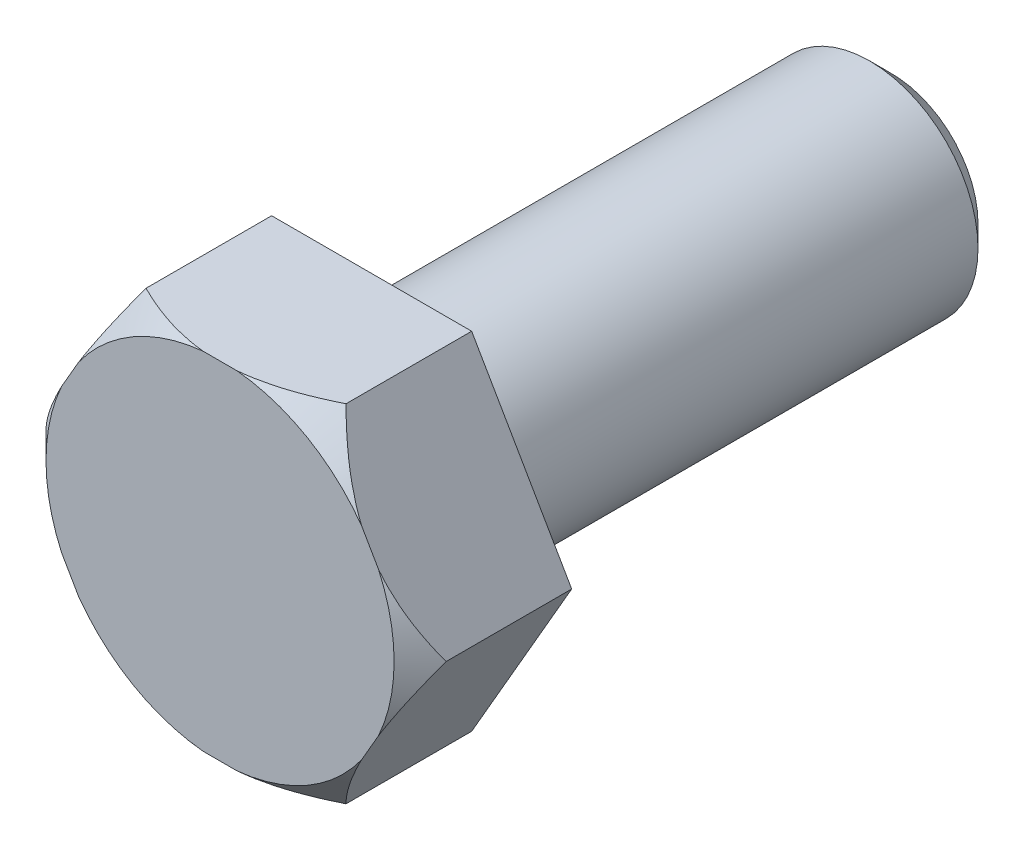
ISO-10303-21;
HEADER;
FILE_DESCRIPTION(('STEP AP214'),'2;1');
FILE_NAME('part.step','',(''),(''),'','','');
FILE_SCHEMA(('AUTOMOTIVE_DESIGN { 1 0 10303 214 1 1 1 1 }'));
ENDSEC;
DATA;
#1=APPLICATION_CONTEXT('core data for automotive mechanical design processes');
#2=APPLICATION_PROTOCOL_DEFINITION('international standard','automotive_design',2000,#1);
#3=PRODUCT_CONTEXT('',#1,'mechanical');
#4=PRODUCT('Part','Part','',(#3));
#5=PRODUCT_RELATED_PRODUCT_CATEGORY('part','',(#4));
#6=PRODUCT_DEFINITION_FORMATION('','',#4);
#7=PRODUCT_DEFINITION_CONTEXT('part definition',#1,'design');
#8=PRODUCT_DEFINITION('design','',#6,#7);
#9=PRODUCT_DEFINITION_SHAPE('','',#8);
#10=(LENGTH_UNIT() NAMED_UNIT(*) SI_UNIT(.MILLI.,.METRE.));
#11=(NAMED_UNIT(*) PLANE_ANGLE_UNIT() SI_UNIT($,.RADIAN.));
#12=(NAMED_UNIT(*) SI_UNIT($,.STERADIAN.) SOLID_ANGLE_UNIT());
#13=UNCERTAINTY_MEASURE_WITH_UNIT(LENGTH_MEASURE(1.E-05),#10,'distance_accuracy_value','');
#14=(GEOMETRIC_REPRESENTATION_CONTEXT(3) GLOBAL_UNCERTAINTY_ASSIGNED_CONTEXT((#13)) GLOBAL_UNIT_ASSIGNED_CONTEXT((#10,
#11,#12)) REPRESENTATION_CONTEXT('',''));
#15=CARTESIAN_POINT('',(0.,0.,0.));
#16=DIRECTION('',(0.,0.,1.));
#17=DIRECTION('',(1.,0.,0.));
#18=AXIS2_PLACEMENT_3D('',#15,#16,#17);
#19=CARTESIAN_POINT('',(0.,-2.5,0.));
#20=DIRECTION('',(0.,0.,1.));
#21=DIRECTION('',(1.,0.,0.));
#22=AXIS2_PLACEMENT_3D('',#19,#20,#21);
#23=PLANE('',#22);
#24=CARTESIAN_POINT('',(0.,0.,0.));
#25=DIRECTION('',(0.,0.,1.));
#26=DIRECTION('',(1.,0.,0.));
#27=AXIS2_PLACEMENT_3D('',#24,#25,#26);
#28=CIRCLE('',#27,2.5);
#29=CARTESIAN_POINT('',(2.5,0.,0.));
#30=VERTEX_POINT('',#29);
#31=EDGE_CURVE('E11',#30,#30,#28,.T.);
#32=ORIENTED_EDGE('',*,*,#31,.T.);
#33=EDGE_LOOP('',(#32));
#34=FACE_BOUND('',#33,.T.);
#35=ADVANCED_FACE('F39',(#34),#23,.T.);
#36=CARTESIAN_POINT('',(0.,0.,0.));
#37=DIRECTION('',(0.,0.,1.));
#38=DIRECTION('',(1.,0.,0.));
#39=AXIS2_PLACEMENT_3D('',#36,#37,#38);
#40=CYLINDRICAL_SURFACE('',#39,2.5);
#41=CARTESIAN_POINT('',(0.,0.,-11.5));
#42=DIRECTION('',(0.,0.,1.));
#43=DIRECTION('',(1.,0.,0.));
#44=AXIS2_PLACEMENT_3D('',#41,#42,#43);
#45=CIRCLE('',#44,2.5);
#46=CARTESIAN_POINT('',(2.5,0.,-11.5));
#47=VERTEX_POINT('',#46);
#48=EDGE_CURVE('E45',#47,#47,#45,.T.);
#49=ORIENTED_EDGE('',*,*,#48,.T.);
#50=EDGE_LOOP('',(#49));
#51=FACE_BOUND('',#50,.T.);
#52=ORIENTED_EDGE('',*,*,#31,.F.);
#53=EDGE_LOOP('',(#52));
#54=FACE_BOUND('',#53,.T.);
#55=ADVANCED_FACE('F65',(#51,#54),#40,.T.);
#56=CARTESIAN_POINT('',(0.,0.,-11.5));
#57=DIRECTION('',(0.,0.,1.));
#58=DIRECTION('',(1.,0.,0.));
#59=AXIS2_PLACEMENT_3D('',#56,#57,#58);
#60=CONICAL_SURFACE('',#59,2.5,0.785398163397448);
#61=CARTESIAN_POINT('',(0.,0.,-12.));
#62=DIRECTION('',(0.,0.,1.));
#63=DIRECTION('',(1.,0.,0.));
#64=AXIS2_PLACEMENT_3D('',#61,#62,#63);
#65=CIRCLE('',#64,2.);
#66=CARTESIAN_POINT('',(2.,0.,-12.));
#67=VERTEX_POINT('',#66);
#68=EDGE_CURVE('E49',#67,#67,#65,.T.);
#69=ORIENTED_EDGE('',*,*,#68,.T.);
#70=EDGE_LOOP('',(#69));
#71=FACE_BOUND('',#70,.T.);
#72=ORIENTED_EDGE('',*,*,#48,.F.);
#73=EDGE_LOOP('',(#72));
#74=FACE_BOUND('',#73,.T.);
#75=ADVANCED_FACE('F56',(#71,#74),#60,.T.);
#76=CARTESIAN_POINT('',(0.,-2.,-12.));
#77=DIRECTION('',(0.,0.,-1.));
#78=DIRECTION('',(-1.,0.,0.));
#79=AXIS2_PLACEMENT_3D('',#76,#77,#78);
#80=PLANE('',#79);
#81=ORIENTED_EDGE('',*,*,#68,.F.);
#82=EDGE_LOOP('',(#81));
#83=FACE_BOUND('',#82,.T.);
#84=ADVANCED_FACE('F59',(#83),#80,.T.);
#85=CLOSED_SHELL('',(#35,#55,#75,#84));
#86=MANIFOLD_SOLID_BREP('B2',#85);
#87=CARTESIAN_POINT('',(2.3094010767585,-4.,3.5));
#88=DIRECTION('',(-0.866025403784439,0.5,0.));
#89=DIRECTION('',(-0.5,-0.866025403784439,0.));
#90=AXIS2_PLACEMENT_3D('',#87,#88,#89);
#91=PLANE('',#90);
#92=DIRECTION('',(0.,0.,-1.));
#93=VECTOR('',#92,1.);
#94=CARTESIAN_POINT('',(4.61880215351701,0.,3.5));
#95=LINE('',#94,#93);
#96=CARTESIAN_POINT('',(4.61880215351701,0.,2.9));
#97=VERTEX_POINT('',#96);
#98=CARTESIAN_POINT('',(4.61880215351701,0.,0.));
#99=VERTEX_POINT('',#98);
#100=EDGE_CURVE('E242',#97,#99,#95,.T.);
#101=ORIENTED_EDGE('',*,*,#100,.F.);
#102=CARTESIAN_POINT('',(6.23236114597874,2.79476615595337,0.688498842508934));
#103=CARTESIAN_POINT('',(6.17765325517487,2.70000930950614,0.777178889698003));
#104=CARTESIAN_POINT('',(6.12272857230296,2.60487696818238,0.865328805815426));
#105=CARTESIAN_POINT('',(6.01237057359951,2.41373130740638,1.04036549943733));
#106=CARTESIAN_POINT('',(5.95693721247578,2.31771790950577,1.12725216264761));
#107=CARTESIAN_POINT('',(5.84536515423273,2.12446943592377,1.29974670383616));
#108=CARTESIAN_POINT('',(5.78922510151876,2.02723201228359,1.3853510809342));
#109=CARTESIAN_POINT('',(5.67628342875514,1.83161129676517,1.55479243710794));
#110=CARTESIAN_POINT('',(5.61948182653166,1.73322803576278,1.63862946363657));
#111=CARTESIAN_POINT('',(5.50353794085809,1.53240733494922,1.80647993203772));
#112=CARTESIAN_POINT('',(5.44437430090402,1.42993290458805,1.89043450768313));
#113=CARTESIAN_POINT('',(5.32511378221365,1.22336762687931,2.05564703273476));
#114=CARTESIAN_POINT('',(5.26501693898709,1.11927684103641,2.13690508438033));
#115=CARTESIAN_POINT('',(5.14378925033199,0.909304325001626,2.296059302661));
#116=CARTESIAN_POINT('',(5.08265932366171,0.803424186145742,2.37395825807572));
#117=CARTESIAN_POINT('',(4.95915384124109,0.589506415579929,2.52568435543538));
#118=CARTESIAN_POINT('',(4.89677844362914,0.481469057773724,2.59951200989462));
#119=CARTESIAN_POINT('',(4.76893339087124,0.260034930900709,2.74398038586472));
#120=CARTESIAN_POINT('',(4.7034254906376,0.146571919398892,2.81448663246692));
#121=CARTESIAN_POINT('',(4.570685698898,-0.0833401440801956,2.94879092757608));
#122=CARTESIAN_POINT('',(4.50345356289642,-0.199789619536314,3.01258801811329));
#123=CARTESIAN_POINT('',(4.3674844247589,-0.43529507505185,3.13137401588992));
#124=CARTESIAN_POINT('',(4.29875750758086,-0.554333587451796,3.1864086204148));
#125=CARTESIAN_POINT('',(4.15941510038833,-0.795681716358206,3.28596217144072));
#126=CARTESIAN_POINT('',(4.0888001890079,-0.91799033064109,3.3304842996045));
#127=CARTESIAN_POINT('',(3.95986044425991,-1.14132051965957,3.39923411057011));
#128=CARTESIAN_POINT('',(3.90183954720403,-1.24181566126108,3.42572915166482));
#129=CARTESIAN_POINT('',(3.78491444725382,-1.44433587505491,3.46929589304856));
#130=CARTESIAN_POINT('',(3.72601037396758,-1.54636072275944,3.48636896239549));
#131=CARTESIAN_POINT('',(3.60778145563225,-1.75113921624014,3.5102149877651));
#132=CARTESIAN_POINT('',(3.54845754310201,-1.85389124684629,3.51700617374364));
#133=CARTESIAN_POINT('',(3.42974154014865,-2.059513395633,3.51997326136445));
#134=CARTESIAN_POINT('',(3.3703494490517,-2.16238351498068,3.51614905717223));
#135=CARTESIAN_POINT('',(3.2521230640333,-2.36715762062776,3.49812146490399));
#136=CARTESIAN_POINT('',(3.19328771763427,-2.46906342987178,3.48394524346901));
#137=CARTESIAN_POINT('',(3.07639557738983,-2.67152655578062,3.44597172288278));
#138=CARTESIAN_POINT('',(3.01833897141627,-2.77208354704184,3.42217214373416));
#139=CARTESIAN_POINT('',(2.90311219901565,-2.97166217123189,3.36593528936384));
#140=CARTESIAN_POINT('',(2.84594516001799,-3.0706783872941,3.33347269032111));
#141=CARTESIAN_POINT('',(2.73281133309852,-3.26663192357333,3.26114482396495));
#142=CARTESIAN_POINT('',(2.67684448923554,-3.36356934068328,3.22127990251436));
#143=CARTESIAN_POINT('',(2.54652000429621,-3.58929797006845,3.12008468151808));
#144=CARTESIAN_POINT('',(2.47266940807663,-3.71721095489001,3.05615257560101));
#145=CARTESIAN_POINT('',(2.32705313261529,-3.969425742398,2.91934821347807));
#146=CARTESIAN_POINT('',(2.25528857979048,-4.09372559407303,2.84647123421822));
#147=CARTESIAN_POINT('',(2.11349363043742,-4.33932165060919,2.69363109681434));
#148=CARTESIAN_POINT('',(2.04346714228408,-4.46061108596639,2.61365354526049));
#149=CARTESIAN_POINT('',(1.90505877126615,-4.7003414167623,2.4482849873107));
#150=CARTESIAN_POINT('',(1.83667660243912,-4.81878280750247,2.36289493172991));
#151=CARTESIAN_POINT('',(1.70098891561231,-5.05380077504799,2.18743214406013));
#152=CARTESIAN_POINT('',(1.63368983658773,-5.17036619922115,2.09733958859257));
#153=CARTESIAN_POINT('',(1.50027452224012,-5.401448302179,1.91370612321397));
#154=CARTESIAN_POINT('',(1.43415838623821,-5.51596480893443,1.82016492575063));
#155=CARTESIAN_POINT('',(1.30300471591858,-5.74312962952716,1.63040915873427));
#156=CARTESIAN_POINT('',(1.23796608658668,-5.85577983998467,1.53419760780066));
#157=CARTESIAN_POINT('',(1.10874167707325,-6.07960308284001,1.33950918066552));
#158=CARTESIAN_POINT('',(1.0445559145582,-6.19077608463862,1.24103225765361));
#159=CARTESIAN_POINT('',(0.932766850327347,-6.38440042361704,1.06690301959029));
#160=CARTESIAN_POINT('',(0.885004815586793,-6.46712669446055,0.991657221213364));
#161=CARTESIAN_POINT('',(0.790056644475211,-6.63158175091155,0.840569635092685));
#162=CARTESIAN_POINT('',(0.742868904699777,-6.71331331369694,0.764731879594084));
#163=CARTESIAN_POINT('',(0.695842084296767,-6.79476615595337,0.688498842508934));
#164=B_SPLINE_CURVE_WITH_KNOTS('',3,(#102,#103,#104,#105,#106,#107,#108,#109,#110,#111,#112,
#113,#114,#115,#116,#117,#118,#119,#120,#121,#122,#123,#124,#125,#126,#127,#128,#129,#130,#131,
#132,#133,#134,#135,#136,#137,#138,#139,#140,#141,#142,#143,#144,#145,#146,#147,#148,#149,#150,
#151,#152,#153,#154,#155,#156,#157,#158,#159,#160,#161,#162,#163),.UNSPECIFIED.,.F.,.F.,(4,2,2,
2,2,2,2,2,2,2,2,2,2,2,2,2,2,2,2,2,2,2,2,2,2,2,2,2,2,2,4),(0.,0.422523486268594,
0.845084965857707,1.26864344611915,1.69219053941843,2.12741530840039,2.56262355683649,
2.99746324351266,3.43224806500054,3.87844266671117,4.32470089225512,4.76854968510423,
5.21226397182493,5.56900884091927,5.92570185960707,6.28176171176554,6.63782511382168,
6.99295744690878,7.34817396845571,7.70444045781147,8.06069030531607,8.54311709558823,
9.02579972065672,9.50948415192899,9.99308384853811,10.4789192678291,10.964795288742,
11.450142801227,11.9355003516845,12.3002974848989,12.6635031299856),.UNSPECIFIED.);
#165=CARTESIAN_POINT('',(3.65824766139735,-1.66372918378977,3.5));
#166=VERTEX_POINT('',#165);
#167=EDGE_CURVE('E220',#97,#166,#164,.T.);
#168=ORIENTED_EDGE('',*,*,#167,.T.);
#169=DIRECTION('',(0.5,0.866025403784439,0.));
#170=VECTOR('',#169,1.);
#171=CARTESIAN_POINT('',(2.3094010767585,-4.,3.5));
#172=LINE('',#171,#170);
#173=CARTESIAN_POINT('',(3.26995556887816,-2.33627081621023,3.5));
#174=VERTEX_POINT('',#173);
#175=EDGE_CURVE('E234',#174,#166,#172,.T.);
#176=ORIENTED_EDGE('',*,*,#175,.F.);
#177=CARTESIAN_POINT('',(2.3094010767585,-4.,2.9));
#178=VERTEX_POINT('',#177);
#179=EDGE_CURVE('E307',#174,#178,#164,.T.);
#180=ORIENTED_EDGE('',*,*,#179,.T.);
#181=DIRECTION('',(0.,0.,-1.));
#182=VECTOR('',#181,1.);
#183=CARTESIAN_POINT('',(2.3094010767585,-4.,3.5));
#184=LINE('',#183,#182);
#185=CARTESIAN_POINT('',(2.3094010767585,-4.,0.));
#186=VERTEX_POINT('',#185);
#187=EDGE_CURVE('E215',#178,#186,#184,.T.);
#188=ORIENTED_EDGE('',*,*,#187,.T.);
#189=DIRECTION('',(0.5,0.866025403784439,0.));
#190=VECTOR('',#189,1.);
#191=CARTESIAN_POINT('',(2.3094010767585,-4.,0.));
#192=LINE('',#191,#190);
#193=EDGE_CURVE('E216',#186,#99,#192,.T.);
#194=ORIENTED_EDGE('',*,*,#193,.T.);
#195=EDGE_LOOP('',(#101,#168,#176,#180,#188,#194));
#196=FACE_BOUND('',#195,.T.);
#197=ADVANCED_FACE('F95',(#196),#91,.F.);
#198=CARTESIAN_POINT('',(4.61880215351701,0.,3.5));
#199=DIRECTION('',(-0.866025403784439,-0.5,0.));
#200=DIRECTION('',(0.5,-0.866025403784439,0.));
#201=AXIS2_PLACEMENT_3D('',#198,#199,#200);
#202=PLANE('',#201);
#203=DIRECTION('',(0.,0.,-1.));
#204=VECTOR('',#203,1.);
#205=CARTESIAN_POINT('',(2.3094010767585,4.,3.5));
#206=LINE('',#205,#204);
#207=CARTESIAN_POINT('',(2.3094010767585,4.,2.9));
#208=VERTEX_POINT('',#207);
#209=CARTESIAN_POINT('',(2.3094010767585,4.,0.));
#210=VERTEX_POINT('',#209);
#211=EDGE_CURVE('E241',#208,#210,#206,.T.);
#212=ORIENTED_EDGE('',*,*,#211,.F.);
#213=CARTESIAN_POINT('',(0.695842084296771,6.79476615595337,0.688498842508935));
#214=CARTESIAN_POINT('',(0.75054997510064,6.70000930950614,0.777178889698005));
#215=CARTESIAN_POINT('',(0.805474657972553,6.60487696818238,0.865328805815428));
#216=CARTESIAN_POINT('',(0.915832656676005,6.41373130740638,1.04036549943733));
#217=CARTESIAN_POINT('',(0.971266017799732,6.31771790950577,1.12725216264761));
#218=CARTESIAN_POINT('',(1.08283807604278,6.12446943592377,1.29974670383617));
#219=CARTESIAN_POINT('',(1.13897812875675,6.02723201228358,1.3853510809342));
#220=CARTESIAN_POINT('',(1.25191980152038,5.83161129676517,1.55479243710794));
#221=CARTESIAN_POINT('',(1.30872140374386,5.73322803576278,1.63862946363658));
#222=CARTESIAN_POINT('',(1.42466528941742,5.53240733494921,1.80647993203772));
#223=CARTESIAN_POINT('',(1.48382892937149,5.42993290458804,1.89043450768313));
#224=CARTESIAN_POINT('',(1.60308944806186,5.22336762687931,2.05564703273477));
#225=CARTESIAN_POINT('',(1.66318629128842,5.11927684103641,2.13690508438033));
#226=CARTESIAN_POINT('',(1.78441397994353,4.90930432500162,2.296059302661));
#227=CARTESIAN_POINT('',(1.84554390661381,4.80342418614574,2.37395825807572));
#228=CARTESIAN_POINT('',(1.96904938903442,4.58950641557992,2.52568435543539));
#229=CARTESIAN_POINT('',(2.03142478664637,4.48146905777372,2.59951200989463));
#230=CARTESIAN_POINT('',(2.15926983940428,4.2600349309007,2.74398038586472));
#231=CARTESIAN_POINT('',(2.22477773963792,4.14657191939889,2.81448663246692));
#232=CARTESIAN_POINT('',(2.35751753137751,3.9166598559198,2.94879092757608));
#233=CARTESIAN_POINT('',(2.42474966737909,3.80021038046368,3.01258801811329));
#234=CARTESIAN_POINT('',(2.56071880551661,3.56470492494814,3.13137401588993));
#235=CARTESIAN_POINT('',(2.62944572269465,3.4456664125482,3.1864086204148));
#236=CARTESIAN_POINT('',(2.76878812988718,3.20431828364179,3.28596217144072));
#237=CARTESIAN_POINT('',(2.83940304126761,3.0820096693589,3.3304842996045));
#238=CARTESIAN_POINT('',(2.9683427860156,2.85867948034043,3.39923411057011));
#239=CARTESIAN_POINT('',(3.02636368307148,2.75818433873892,3.42572915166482));
#240=CARTESIAN_POINT('',(3.14328878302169,2.55566412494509,3.46929589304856));
#241=CARTESIAN_POINT('',(3.20219285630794,2.45363927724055,3.48636896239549));
#242=CARTESIAN_POINT('',(3.32042177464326,2.24886078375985,3.5102149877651));
#243=CARTESIAN_POINT('',(3.3797456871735,2.1461087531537,3.51700617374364));
#244=CARTESIAN_POINT('',(3.49846169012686,1.94048660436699,3.51997326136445));
#245=CARTESIAN_POINT('',(3.55785378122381,1.83761648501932,3.51614905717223));
#246=CARTESIAN_POINT('',(3.67608016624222,1.63284237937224,3.49812146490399));
#247=CARTESIAN_POINT('',(3.73491551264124,1.53093657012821,3.48394524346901));
#248=CARTESIAN_POINT('',(3.85180765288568,1.32847344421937,3.44597172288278));
#249=CARTESIAN_POINT('',(3.90986425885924,1.22791645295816,3.42217214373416));
#250=CARTESIAN_POINT('',(4.02509103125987,1.02833782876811,3.36593528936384));
#251=CARTESIAN_POINT('',(4.08225807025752,0.929321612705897,3.33347269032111));
#252=CARTESIAN_POINT('',(4.19539189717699,0.733368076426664,3.26114482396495));
#253=CARTESIAN_POINT('',(4.25135874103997,0.636430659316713,3.22127990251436));
#254=CARTESIAN_POINT('',(4.3816832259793,0.410702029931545,3.12008468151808));
#255=CARTESIAN_POINT('',(4.45553382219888,0.282789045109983,3.05615257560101));
#256=CARTESIAN_POINT('',(4.60115009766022,0.0305742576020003,2.91934821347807));
#257=CARTESIAN_POINT('',(4.67291465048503,-0.0937255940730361,2.84647123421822));
#258=CARTESIAN_POINT('',(4.81470959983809,-0.33932165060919,2.69363109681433));
#259=CARTESIAN_POINT('',(4.88473608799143,-0.460611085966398,2.61365354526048));
#260=CARTESIAN_POINT('',(5.02314445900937,-0.700341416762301,2.4482849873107));
#261=CARTESIAN_POINT('',(5.0915266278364,-0.818782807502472,2.36289493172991));
#262=CARTESIAN_POINT('',(5.2272143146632,-1.05380077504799,2.18743214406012));
#263=CARTESIAN_POINT('',(5.29451339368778,-1.17036619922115,2.09733958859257));
#264=CARTESIAN_POINT('',(5.4279287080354,-1.401448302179,1.91370612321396));
#265=CARTESIAN_POINT('',(5.4940448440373,-1.51596480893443,1.82016492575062));
#266=CARTESIAN_POINT('',(5.62519851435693,-1.74312962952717,1.63040915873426));
#267=CARTESIAN_POINT('',(5.69023714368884,-1.85577983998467,1.53419760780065));
#268=CARTESIAN_POINT('',(5.81946155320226,-2.07960308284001,1.33950918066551));
#269=CARTESIAN_POINT('',(5.88364731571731,-2.19077608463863,1.24103225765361));
#270=CARTESIAN_POINT('',(5.99543637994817,-2.38440042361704,1.06690301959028));
#271=CARTESIAN_POINT('',(6.04319841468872,-2.46712669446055,0.991657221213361));
#272=CARTESIAN_POINT('',(6.1381465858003,-2.63158175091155,0.840569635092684));
#273=CARTESIAN_POINT('',(6.18533432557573,-2.71331331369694,0.764731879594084));
#274=CARTESIAN_POINT('',(6.23236114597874,-2.79476615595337,0.688498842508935));
#275=B_SPLINE_CURVE_WITH_KNOTS('',3,(#213,#214,#215,#216,#217,#218,#219,#220,#221,#222,#223,
#224,#225,#226,#227,#228,#229,#230,#231,#232,#233,#234,#235,#236,#237,#238,#239,#240,#241,#242,
#243,#244,#245,#246,#247,#248,#249,#250,#251,#252,#253,#254,#255,#256,#257,#258,#259,#260,#261,
#262,#263,#264,#265,#266,#267,#268,#269,#270,#271,#272,#273,#274),.UNSPECIFIED.,.F.,.F.,(4,2,2,
2,2,2,2,2,2,2,2,2,2,2,2,2,2,2,2,2,2,2,2,2,2,2,2,2,2,2,4),(0.,0.422523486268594,
0.845084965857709,1.26864344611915,1.69219053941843,2.12741530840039,2.5626235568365,
2.99746324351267,3.43224806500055,3.87844266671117,4.32470089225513,4.76854968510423,
5.21226397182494,5.56900884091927,5.92570185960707,6.28176171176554,6.63782511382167,
6.99295744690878,7.34817396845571,7.70444045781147,8.06069030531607,8.54311709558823,
9.02579972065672,9.50948415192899,9.99308384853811,10.4789192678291,10.9647952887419,
11.450142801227,11.9355003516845,12.3002974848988,12.6635031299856),.UNSPECIFIED.);
#276=CARTESIAN_POINT('',(3.26995556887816,2.33627081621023,3.5));
#277=VERTEX_POINT('',#276);
#278=EDGE_CURVE('E270',#208,#277,#275,.T.);
#279=ORIENTED_EDGE('',*,*,#278,.T.);
#280=DIRECTION('',(-0.5,0.866025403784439,0.));
#281=VECTOR('',#280,1.);
#282=CARTESIAN_POINT('',(4.61880215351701,0.,3.5));
#283=LINE('',#282,#281);
#284=CARTESIAN_POINT('',(3.65824766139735,1.66372918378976,3.5));
#285=VERTEX_POINT('',#284);
#286=EDGE_CURVE('E209',#285,#277,#283,.T.);
#287=ORIENTED_EDGE('',*,*,#286,.F.);
#288=EDGE_CURVE('E275',#285,#97,#275,.T.);
#289=ORIENTED_EDGE('',*,*,#288,.T.);
#290=ORIENTED_EDGE('',*,*,#100,.T.);
#291=DIRECTION('',(-0.5,0.866025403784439,0.));
#292=VECTOR('',#291,1.);
#293=CARTESIAN_POINT('',(4.61880215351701,0.,0.));
#294=LINE('',#293,#292);
#295=EDGE_CURVE('E219',#99,#210,#294,.T.);
#296=ORIENTED_EDGE('',*,*,#295,.T.);
#297=EDGE_LOOP('',(#212,#279,#287,#289,#290,#296));
#298=FACE_BOUND('',#297,.T.);
#299=ADVANCED_FACE('F280',(#298),#202,.F.);
#300=CARTESIAN_POINT('',(2.3094010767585,4.,3.5));
#301=DIRECTION('',(0.,-1.,0.));
#302=DIRECTION('',(1.,0.,0.));
#303=AXIS2_PLACEMENT_3D('',#300,#301,#302);
#304=PLANE('',#303);
#305=DIRECTION('',(0.,0.,-1.));
#306=VECTOR('',#305,1.);
#307=CARTESIAN_POINT('',(-2.3094010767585,4.,3.5));
#308=LINE('',#307,#306);
#309=CARTESIAN_POINT('',(-2.3094010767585,4.,2.9));
#310=VERTEX_POINT('',#309);
#311=CARTESIAN_POINT('',(-2.3094010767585,4.,0.));
#312=VERTEX_POINT('',#311);
#313=EDGE_CURVE('E239',#310,#312,#308,.T.);
#314=ORIENTED_EDGE('',*,*,#313,.F.);
#315=CARTESIAN_POINT('',(-5.10416723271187,4.,1.03401047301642));
#316=CARTESIAN_POINT('',(-4.98985882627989,4.,1.12396648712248));
#317=CARTESIAN_POINT('',(-4.87500222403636,4.,1.21323480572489));
#318=CARTESIAN_POINT('',(-4.64398100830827,4.,1.39010065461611));
#319=CARTESIAN_POINT('',(-4.52781618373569,4.,1.47769790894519));
#320=CARTESIAN_POINT('',(-4.29341594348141,4.,1.6513323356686));
#321=CARTESIAN_POINT('',(-4.17517305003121,4.,1.7373594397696));
#322=CARTESIAN_POINT('',(-3.93695487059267,4.,1.90697407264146));
#323=CARTESIAN_POINT('',(-3.81697966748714,4.,1.99056171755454));
#324=CARTESIAN_POINT('',(-3.56903053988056,4.,2.15883212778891));
#325=CARTESIAN_POINT('',(-3.44095437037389,4.,2.24336480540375));
#326=CARTESIAN_POINT('',(-3.18221357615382,4.,2.40836670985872));
#327=CARTESIAN_POINT('',(-3.05154916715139,4.,2.48883627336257));
#328=CARTESIAN_POINT('',(-2.78744760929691,4.,2.6445324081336));
#329=CARTESIAN_POINT('',(-2.65401614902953,4.,2.71976857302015));
#330=CARTESIAN_POINT('',(-2.38373289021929,4.,2.86379345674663));
#331=CARTESIAN_POINT('',(-2.24688202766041,4.,2.93258391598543));
#332=CARTESIAN_POINT('',(-1.98367043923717,4.,3.05530153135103));
#333=CARTESIAN_POINT('',(-1.85768607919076,4.,3.11002999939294));
#334=CARTESIAN_POINT('',(-1.60243753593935,4.,3.21135635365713));
#335=CARTESIAN_POINT('',(-1.47317303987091,4.,3.25795346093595));
#336=CARTESIAN_POINT('',(-1.21292441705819,4.,3.34074586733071));
#337=CARTESIAN_POINT('',(-1.08197637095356,4.,3.37705304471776));
#338=CARTESIAN_POINT('',(-0.817433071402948,4.,3.43815768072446));
#339=CARTESIAN_POINT('',(-0.683838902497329,4.,3.46295975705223));
#340=CARTESIAN_POINT('',(-0.412316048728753,4.,3.49989685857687));
#341=CARTESIAN_POINT('',(-0.274353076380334,4.,3.51178529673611));
#342=CARTESIAN_POINT('',(0.00205892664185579,4.,3.52118634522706));
#343=CARTESIAN_POINT('',(0.1405079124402,4.,3.51870024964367));
#344=CARTESIAN_POINT('',(0.41681462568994,4.,3.49951454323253));
#345=CARTESIAN_POINT('',(0.554669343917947,4.,3.48277242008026));
#346=CARTESIAN_POINT('',(0.828137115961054,4.,3.43620184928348));
#347=CARTESIAN_POINT('',(0.963749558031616,4.,3.40636988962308));
#348=CARTESIAN_POINT('',(1.27307598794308,4.,3.32450160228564));
#349=CARTESIAN_POINT('',(1.44572159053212,4.,3.26846152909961));
#350=CARTESIAN_POINT('',(1.78533180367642,4.,3.14129797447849));
#351=CARTESIAN_POINT('',(1.95229295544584,4.,3.07016549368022));
#352=CARTESIAN_POINT('',(2.28202183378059,4.,2.91595160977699));
#353=CARTESIAN_POINT('',(2.44474983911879,4.,2.83278642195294));
#354=CARTESIAN_POINT('',(2.76538092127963,4.,2.65780460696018));
#355=CARTESIAN_POINT('',(2.92328510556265,4.,2.56598998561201));
#356=CARTESIAN_POINT('',(3.25793446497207,4.,2.36185945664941));
#357=CARTESIAN_POINT('',(3.43404610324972,4.,2.24851177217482));
#358=CARTESIAN_POINT('',(3.78201930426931,4.,2.01543949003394));
#359=CARTESIAN_POINT('',(3.95387990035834,4.,1.89571346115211));
#360=CARTESIAN_POINT('',(4.29033684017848,4.,1.65419733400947));
#361=CARTESIAN_POINT('',(4.45500968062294,4.,1.53251336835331));
#362=CARTESIAN_POINT('',(4.69993893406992,4.,1.34736923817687));
#363=CARTESIAN_POINT('',(4.78120758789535,4.,1.28524011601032));
#364=CARTESIAN_POINT('',(4.94313113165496,4.,1.16019346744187));
#365=CARTESIAN_POINT('',(5.02378604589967,4.,1.09727597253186));
#366=CARTESIAN_POINT('',(5.10416723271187,4.,1.03401047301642));
#367=B_SPLINE_CURVE_WITH_KNOTS('',3,(#315,#316,#317,#318,#319,#320,#321,#322,#323,#324,#325,
#326,#327,#328,#329,#330,#331,#332,#333,#334,#335,#336,#337,#338,#339,#340,#341,#342,#343,#344,
#345,#346,#347,#348,#349,#350,#351,#352,#353,#354,#355,#356,#357,#358,#359,#360,#361,#362,#363,
#364,#365,#366),.UNSPECIFIED.,.F.,.F.,(4,2,2,2,2,2,2,2,2,2,2,2,2,2,2,2,2,2,2,2,2,2,2,2,2,4),(0.,
0.436384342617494,0.872840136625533,1.31149215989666,1.75012326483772,2.2104351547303,
2.67070884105,3.13011523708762,3.58939722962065,4.00124375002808,4.4131297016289,
4.82034865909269,5.22740403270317,5.64210248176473,6.05676359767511,6.47266560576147,
6.88867926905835,7.43226364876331,7.97617307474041,8.52407040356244,9.07184098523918,
9.6999549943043,10.3282105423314,10.9424080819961,11.2492945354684,11.5561687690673),.UNSPECIFIED.);
#368=CARTESIAN_POINT('',(-0.388292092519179,4.,3.5));
#369=VERTEX_POINT('',#368);
#370=EDGE_CURVE('E257',#310,#369,#367,.T.);
#371=ORIENTED_EDGE('',*,*,#370,.T.);
#372=DIRECTION('',(-1.,0.,0.));
#373=VECTOR('',#372,1.);
#374=CARTESIAN_POINT('',(2.3094010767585,4.,3.5));
#375=LINE('',#374,#373);
#376=CARTESIAN_POINT('',(0.38829209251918,4.,3.5));
#377=VERTEX_POINT('',#376);
#378=EDGE_CURVE('E205',#377,#369,#375,.T.);
#379=ORIENTED_EDGE('',*,*,#378,.F.);
#380=EDGE_CURVE('E263',#377,#208,#367,.T.);
#381=ORIENTED_EDGE('',*,*,#380,.T.);
#382=ORIENTED_EDGE('',*,*,#211,.T.);
#383=DIRECTION('',(-1.,0.,0.));
#384=VECTOR('',#383,1.);
#385=CARTESIAN_POINT('',(2.3094010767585,4.,0.));
#386=LINE('',#385,#384);
#387=EDGE_CURVE('E223',#210,#312,#386,.T.);
#388=ORIENTED_EDGE('',*,*,#387,.T.);
#389=EDGE_LOOP('',(#314,#371,#379,#381,#382,#388));
#390=FACE_BOUND('',#389,.T.);
#391=ADVANCED_FACE('F261',(#390),#304,.F.);
#392=CARTESIAN_POINT('',(-2.3094010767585,4.,3.5));
#393=DIRECTION('',(0.866025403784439,-0.5,0.));
#394=DIRECTION('',(0.5,0.866025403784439,0.));
#395=AXIS2_PLACEMENT_3D('',#392,#393,#394);
#396=PLANE('',#395);
#397=DIRECTION('',(0.,0.,-1.));
#398=VECTOR('',#397,1.);
#399=CARTESIAN_POINT('',(-4.61880215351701,0.,3.5));
#400=LINE('',#399,#398);
#401=CARTESIAN_POINT('',(-4.61880215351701,0.,2.9));
#402=VERTEX_POINT('',#401);
#403=CARTESIAN_POINT('',(-4.61880215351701,0.,0.));
#404=VERTEX_POINT('',#403);
#405=EDGE_CURVE('E197',#402,#404,#400,.T.);
#406=ORIENTED_EDGE('',*,*,#405,.F.);
#407=CARTESIAN_POINT('',(-6.23236114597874,-2.79476615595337,0.688498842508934));
#408=CARTESIAN_POINT('',(-6.17765325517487,-2.70000930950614,0.777178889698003));
#409=CARTESIAN_POINT('',(-6.12272857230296,-2.60487696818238,0.865328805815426));
#410=CARTESIAN_POINT('',(-6.01237057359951,-2.41373130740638,1.04036549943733));
#411=CARTESIAN_POINT('',(-5.95693721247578,-2.31771790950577,1.12725216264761));
#412=CARTESIAN_POINT('',(-5.84536515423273,-2.12446943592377,1.29974670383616));
#413=CARTESIAN_POINT('',(-5.78922510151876,-2.02723201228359,1.3853510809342));
#414=CARTESIAN_POINT('',(-5.67628342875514,-1.83161129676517,1.55479243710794));
#415=CARTESIAN_POINT('',(-5.61948182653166,-1.73322803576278,1.63862946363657));
#416=CARTESIAN_POINT('',(-5.50353794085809,-1.53240733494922,1.80647993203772));
#417=CARTESIAN_POINT('',(-5.44437430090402,-1.42993290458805,1.89043450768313));
#418=CARTESIAN_POINT('',(-5.32511378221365,-1.22336762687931,2.05564703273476));
#419=CARTESIAN_POINT('',(-5.26501693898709,-1.11927684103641,2.13690508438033));
#420=CARTESIAN_POINT('',(-5.14378925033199,-0.909304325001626,2.296059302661));
#421=CARTESIAN_POINT('',(-5.08265932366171,-0.803424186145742,2.37395825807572));
#422=CARTESIAN_POINT('',(-4.95915384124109,-0.589506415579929,2.52568435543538));
#423=CARTESIAN_POINT('',(-4.89677844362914,-0.481469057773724,2.59951200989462));
#424=CARTESIAN_POINT('',(-4.76893339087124,-0.260034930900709,2.74398038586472));
#425=CARTESIAN_POINT('',(-4.7034254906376,-0.146571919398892,2.81448663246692));
#426=CARTESIAN_POINT('',(-4.570685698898,0.0833401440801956,2.94879092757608));
#427=CARTESIAN_POINT('',(-4.50345356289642,0.199789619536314,3.01258801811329));
#428=CARTESIAN_POINT('',(-4.3674844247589,0.43529507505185,3.13137401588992));
#429=CARTESIAN_POINT('',(-4.29875750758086,0.554333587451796,3.1864086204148));
#430=CARTESIAN_POINT('',(-4.15941510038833,0.795681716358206,3.28596217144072));
#431=CARTESIAN_POINT('',(-4.0888001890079,0.91799033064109,3.3304842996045));
#432=CARTESIAN_POINT('',(-3.95986044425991,1.14132051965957,3.39923411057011));
#433=CARTESIAN_POINT('',(-3.90183954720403,1.24181566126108,3.42572915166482));
#434=CARTESIAN_POINT('',(-3.78491444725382,1.44433587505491,3.46929589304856));
#435=CARTESIAN_POINT('',(-3.72601037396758,1.54636072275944,3.48636896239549));
#436=CARTESIAN_POINT('',(-3.60778145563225,1.75113921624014,3.5102149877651));
#437=CARTESIAN_POINT('',(-3.54845754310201,1.85389124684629,3.51700617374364));
#438=CARTESIAN_POINT('',(-3.42974154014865,2.059513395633,3.51997326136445));
#439=CARTESIAN_POINT('',(-3.3703494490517,2.16238351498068,3.51614905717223));
#440=CARTESIAN_POINT('',(-3.2521230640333,2.36715762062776,3.49812146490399));
#441=CARTESIAN_POINT('',(-3.19328771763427,2.46906342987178,3.48394524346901));
#442=CARTESIAN_POINT('',(-3.07639557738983,2.67152655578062,3.44597172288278));
#443=CARTESIAN_POINT('',(-3.01833897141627,2.77208354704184,3.42217214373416));
#444=CARTESIAN_POINT('',(-2.90311219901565,2.97166217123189,3.36593528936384));
#445=CARTESIAN_POINT('',(-2.84594516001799,3.0706783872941,3.33347269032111));
#446=CARTESIAN_POINT('',(-2.73281133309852,3.26663192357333,3.26114482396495));
#447=CARTESIAN_POINT('',(-2.67684448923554,3.36356934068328,3.22127990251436));
#448=CARTESIAN_POINT('',(-2.54652000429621,3.58929797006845,3.12008468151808));
#449=CARTESIAN_POINT('',(-2.47266940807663,3.71721095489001,3.05615257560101));
#450=CARTESIAN_POINT('',(-2.32705313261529,3.969425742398,2.91934821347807));
#451=CARTESIAN_POINT('',(-2.25528857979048,4.09372559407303,2.84647123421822));
#452=CARTESIAN_POINT('',(-2.11349363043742,4.33932165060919,2.69363109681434));
#453=CARTESIAN_POINT('',(-2.04346714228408,4.46061108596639,2.61365354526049));
#454=CARTESIAN_POINT('',(-1.90505877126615,4.7003414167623,2.4482849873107));
#455=CARTESIAN_POINT('',(-1.83667660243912,4.81878280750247,2.36289493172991));
#456=CARTESIAN_POINT('',(-1.70098891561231,5.05380077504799,2.18743214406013));
#457=CARTESIAN_POINT('',(-1.63368983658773,5.17036619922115,2.09733958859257));
#458=CARTESIAN_POINT('',(-1.50027452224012,5.401448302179,1.91370612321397));
#459=CARTESIAN_POINT('',(-1.43415838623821,5.51596480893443,1.82016492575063));
#460=CARTESIAN_POINT('',(-1.30300471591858,5.74312962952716,1.63040915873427));
#461=CARTESIAN_POINT('',(-1.23796608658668,5.85577983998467,1.53419760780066));
#462=CARTESIAN_POINT('',(-1.10874167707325,6.07960308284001,1.33950918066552));
#463=CARTESIAN_POINT('',(-1.0445559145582,6.19077608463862,1.24103225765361));
#464=CARTESIAN_POINT('',(-0.932766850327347,6.38440042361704,1.06690301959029));
#465=CARTESIAN_POINT('',(-0.885004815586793,6.46712669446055,0.991657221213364));
#466=CARTESIAN_POINT('',(-0.790056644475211,6.63158175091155,0.840569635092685));
#467=CARTESIAN_POINT('',(-0.742868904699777,6.71331331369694,0.764731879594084));
#468=CARTESIAN_POINT('',(-0.695842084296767,6.79476615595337,0.688498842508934));
#469=B_SPLINE_CURVE_WITH_KNOTS('',3,(#407,#408,#409,#410,#411,#412,#413,#414,#415,#416,#417,
#418,#419,#420,#421,#422,#423,#424,#425,#426,#427,#428,#429,#430,#431,#432,#433,#434,#435,#436,
#437,#438,#439,#440,#441,#442,#443,#444,#445,#446,#447,#448,#449,#450,#451,#452,#453,#454,#455,
#456,#457,#458,#459,#460,#461,#462,#463,#464,#465,#466,#467,#468),.UNSPECIFIED.,.F.,.F.,(4,2,2,
2,2,2,2,2,2,2,2,2,2,2,2,2,2,2,2,2,2,2,2,2,2,2,2,2,2,2,4),(0.,0.422523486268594,
0.845084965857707,1.26864344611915,1.69219053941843,2.12741530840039,2.56262355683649,
2.99746324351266,3.43224806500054,3.87844266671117,4.32470089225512,4.76854968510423,
5.21226397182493,5.56900884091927,5.92570185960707,6.28176171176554,6.63782511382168,
6.99295744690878,7.34817396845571,7.70444045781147,8.06069030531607,8.54311709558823,
9.02579972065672,9.50948415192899,9.99308384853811,10.4789192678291,10.964795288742,
11.450142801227,11.9355003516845,12.3002974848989,12.6635031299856),.UNSPECIFIED.);
#470=CARTESIAN_POINT('',(-3.65824766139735,1.66372918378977,3.5));
#471=VERTEX_POINT('',#470);
#472=EDGE_CURVE('E184',#402,#471,#469,.T.);
#473=ORIENTED_EDGE('',*,*,#472,.T.);
#474=DIRECTION('',(-0.5,-0.866025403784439,0.));
#475=VECTOR('',#474,1.);
#476=CARTESIAN_POINT('',(-2.3094010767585,4.,3.5));
#477=LINE('',#476,#475);
#478=CARTESIAN_POINT('',(-3.26995556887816,2.33627081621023,3.5));
#479=VERTEX_POINT('',#478);
#480=EDGE_CURVE('E195',#479,#471,#477,.T.);
#481=ORIENTED_EDGE('',*,*,#480,.F.);
#482=EDGE_CURVE('E198',#479,#310,#469,.T.);
#483=ORIENTED_EDGE('',*,*,#482,.T.);
#484=ORIENTED_EDGE('',*,*,#313,.T.);
#485=DIRECTION('',(-0.5,-0.866025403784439,0.));
#486=VECTOR('',#485,1.);
#487=CARTESIAN_POINT('',(-2.3094010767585,4.,0.));
#488=LINE('',#487,#486);
#489=EDGE_CURVE('E226',#312,#404,#488,.T.);
#490=ORIENTED_EDGE('',*,*,#489,.T.);
#491=EDGE_LOOP('',(#406,#473,#481,#483,#484,#490));
#492=FACE_BOUND('',#491,.T.);
#493=ADVANCED_FACE('F193',(#492),#396,.F.);
#494=CARTESIAN_POINT('',(-4.61880215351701,0.,3.5));
#495=DIRECTION('',(0.866025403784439,0.5,0.));
#496=DIRECTION('',(-0.5,0.866025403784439,0.));
#497=AXIS2_PLACEMENT_3D('',#494,#495,#496);
#498=PLANE('',#497);
#499=DIRECTION('',(0.,0.,-1.));
#500=VECTOR('',#499,1.);
#501=CARTESIAN_POINT('',(-2.3094010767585,-4.,3.5));
#502=LINE('',#501,#500);
#503=CARTESIAN_POINT('',(-2.3094010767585,-4.,2.9));
#504=VERTEX_POINT('',#503);
#505=CARTESIAN_POINT('',(-2.3094010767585,-4.,0.));
#506=VERTEX_POINT('',#505);
#507=EDGE_CURVE('E236',#504,#506,#502,.T.);
#508=ORIENTED_EDGE('',*,*,#507,.F.);
#509=CARTESIAN_POINT('',(-0.695842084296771,-6.79476615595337,0.688498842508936));
#510=CARTESIAN_POINT('',(-0.750549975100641,-6.70000930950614,0.777178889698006));
#511=CARTESIAN_POINT('',(-0.805474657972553,-6.60487696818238,0.865328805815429));
#512=CARTESIAN_POINT('',(-0.915832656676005,-6.41373130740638,1.04036549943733));
#513=CARTESIAN_POINT('',(-0.971266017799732,-6.31771790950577,1.12725216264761));
#514=CARTESIAN_POINT('',(-1.08283807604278,-6.12446943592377,1.29974670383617));
#515=CARTESIAN_POINT('',(-1.13897812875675,-6.02723201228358,1.3853510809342));
#516=CARTESIAN_POINT('',(-1.25191980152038,-5.83161129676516,1.55479243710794));
#517=CARTESIAN_POINT('',(-1.30872140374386,-5.73322803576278,1.63862946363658));
#518=CARTESIAN_POINT('',(-1.42466528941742,-5.53240733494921,1.80647993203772));
#519=CARTESIAN_POINT('',(-1.4838289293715,-5.42993290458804,1.89043450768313));
#520=CARTESIAN_POINT('',(-1.60308944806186,-5.22336762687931,2.05564703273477));
#521=CARTESIAN_POINT('',(-1.66318629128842,-5.11927684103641,2.13690508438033));
#522=CARTESIAN_POINT('',(-1.78441397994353,-4.90930432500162,2.296059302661));
#523=CARTESIAN_POINT('',(-1.84554390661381,-4.80342418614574,2.37395825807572));
#524=CARTESIAN_POINT('',(-1.96904938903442,-4.58950641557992,2.52568435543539));
#525=CARTESIAN_POINT('',(-2.03142478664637,-4.48146905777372,2.59951200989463));
#526=CARTESIAN_POINT('',(-2.15926983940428,-4.2600349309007,2.74398038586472));
#527=CARTESIAN_POINT('',(-2.22477773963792,-4.14657191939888,2.81448663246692));
#528=CARTESIAN_POINT('',(-2.35751753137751,-3.9166598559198,2.94879092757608));
#529=CARTESIAN_POINT('',(-2.42474966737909,-3.80021038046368,3.01258801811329));
#530=CARTESIAN_POINT('',(-2.56071880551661,-3.56470492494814,3.13137401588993));
#531=CARTESIAN_POINT('',(-2.62944572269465,-3.4456664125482,3.1864086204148));
#532=CARTESIAN_POINT('',(-2.76878812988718,-3.20431828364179,3.28596217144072));
#533=CARTESIAN_POINT('',(-2.83940304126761,-3.0820096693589,3.3304842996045));
#534=CARTESIAN_POINT('',(-2.9683427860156,-2.85867948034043,3.39923411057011));
#535=CARTESIAN_POINT('',(-3.02636368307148,-2.75818433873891,3.42572915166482));
#536=CARTESIAN_POINT('',(-3.14328878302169,-2.55566412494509,3.46929589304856));
#537=CARTESIAN_POINT('',(-3.20219285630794,-2.45363927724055,3.48636896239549));
#538=CARTESIAN_POINT('',(-3.32042177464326,-2.24886078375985,3.5102149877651));
#539=CARTESIAN_POINT('',(-3.3797456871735,-2.1461087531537,3.51700617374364));
#540=CARTESIAN_POINT('',(-3.49846169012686,-1.94048660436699,3.51997326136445));
#541=CARTESIAN_POINT('',(-3.55785378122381,-1.83761648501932,3.51614905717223));
#542=CARTESIAN_POINT('',(-3.67608016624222,-1.63284237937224,3.49812146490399));
#543=CARTESIAN_POINT('',(-3.73491551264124,-1.53093657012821,3.483945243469));
#544=CARTESIAN_POINT('',(-3.85180765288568,-1.32847344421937,3.44597172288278));
#545=CARTESIAN_POINT('',(-3.90986425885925,-1.22791645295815,3.42217214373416));
#546=CARTESIAN_POINT('',(-4.02509103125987,-1.0283378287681,3.36593528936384));
#547=CARTESIAN_POINT('',(-4.08225807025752,-0.929321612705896,3.33347269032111));
#548=CARTESIAN_POINT('',(-4.19539189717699,-0.733368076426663,3.26114482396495));
#549=CARTESIAN_POINT('',(-4.25135874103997,-0.636430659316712,3.22127990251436));
#550=CARTESIAN_POINT('',(-4.3816832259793,-0.410702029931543,3.12008468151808));
#551=CARTESIAN_POINT('',(-4.45553382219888,-0.282789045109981,3.05615257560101));
#552=CARTESIAN_POINT('',(-4.60115009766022,-0.0305742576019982,2.91934821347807));
#553=CARTESIAN_POINT('',(-4.67291465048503,0.0937255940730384,2.84647123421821));
#554=CARTESIAN_POINT('',(-4.81470959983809,0.339321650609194,2.69363109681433));
#555=CARTESIAN_POINT('',(-4.88473608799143,0.460611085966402,2.61365354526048));
#556=CARTESIAN_POINT('',(-5.02314445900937,0.700341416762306,2.44828498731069));
#557=CARTESIAN_POINT('',(-5.0915266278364,0.818782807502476,2.3628949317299));
#558=CARTESIAN_POINT('',(-5.2272143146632,1.053800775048,2.18743214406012));
#559=CARTESIAN_POINT('',(-5.29451339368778,1.17036619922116,2.09733958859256));
#560=CARTESIAN_POINT('',(-5.4279287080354,1.40144830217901,1.91370612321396));
#561=CARTESIAN_POINT('',(-5.4940448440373,1.51596480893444,1.82016492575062));
#562=CARTESIAN_POINT('',(-5.62519851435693,1.74312962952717,1.63040915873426));
#563=CARTESIAN_POINT('',(-5.69023714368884,1.85577983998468,1.53419760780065));
#564=CARTESIAN_POINT('',(-5.81946155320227,2.07960308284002,1.33950918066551));
#565=CARTESIAN_POINT('',(-5.88364731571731,2.19077608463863,1.2410322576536));
#566=CARTESIAN_POINT('',(-5.99543637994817,2.38440042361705,1.06690301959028));
#567=CARTESIAN_POINT('',(-6.04319841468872,2.46712669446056,0.991657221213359));
#568=CARTESIAN_POINT('',(-6.1381465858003,2.63158175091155,0.840569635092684));
#569=CARTESIAN_POINT('',(-6.18533432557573,2.71331331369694,0.764731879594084));
#570=CARTESIAN_POINT('',(-6.23236114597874,2.79476615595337,0.688498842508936));
#571=B_SPLINE_CURVE_WITH_KNOTS('',3,(#509,#510,#511,#512,#513,#514,#515,#516,#517,#518,#519,
#520,#521,#522,#523,#524,#525,#526,#527,#528,#529,#530,#531,#532,#533,#534,#535,#536,#537,#538,
#539,#540,#541,#542,#543,#544,#545,#546,#547,#548,#549,#550,#551,#552,#553,#554,#555,#556,#557,
#558,#559,#560,#561,#562,#563,#564,#565,#566,#567,#568,#569,#570),.UNSPECIFIED.,.F.,.F.,(4,2,2,
2,2,2,2,2,2,2,2,2,2,2,2,2,2,2,2,2,2,2,2,2,2,2,2,2,2,2,4),(0.,0.422523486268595,
0.845084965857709,1.26864344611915,1.69219053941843,2.12741530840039,2.5626235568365,
2.99746324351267,3.43224806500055,3.87844266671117,4.32470089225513,4.76854968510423,
5.21226397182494,5.56900884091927,5.92570185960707,6.28176171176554,6.63782511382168,
6.99295744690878,7.34817396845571,7.70444045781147,8.06069030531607,8.54311709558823,
9.02579972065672,9.50948415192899,9.99308384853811,10.4789192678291,10.964795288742,
11.450142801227,11.9355003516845,12.3002974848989,12.6635031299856),.UNSPECIFIED.);
#572=CARTESIAN_POINT('',(-3.26995556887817,-2.33627081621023,3.5));
#573=VERTEX_POINT('',#572);
#574=EDGE_CURVE('E300',#504,#573,#571,.T.);
#575=ORIENTED_EDGE('',*,*,#574,.T.);
#576=DIRECTION('',(0.5,-0.866025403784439,0.));
#577=VECTOR('',#576,1.);
#578=CARTESIAN_POINT('',(-4.61880215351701,0.,3.5));
#579=LINE('',#578,#577);
#580=CARTESIAN_POINT('',(-3.65824766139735,-1.66372918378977,3.5));
#581=VERTEX_POINT('',#580);
#582=EDGE_CURVE('E204',#581,#573,#579,.T.);
#583=ORIENTED_EDGE('',*,*,#582,.F.);
#584=EDGE_CURVE('E119',#581,#402,#571,.T.);
#585=ORIENTED_EDGE('',*,*,#584,.T.);
#586=ORIENTED_EDGE('',*,*,#405,.T.);
#587=DIRECTION('',(0.5,-0.866025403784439,0.));
#588=VECTOR('',#587,1.);
#589=CARTESIAN_POINT('',(-4.61880215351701,0.,0.));
#590=LINE('',#589,#588);
#591=EDGE_CURVE('E228',#404,#506,#590,.T.);
#592=ORIENTED_EDGE('',*,*,#591,.T.);
#593=EDGE_LOOP('',(#508,#575,#583,#585,#586,#592));
#594=FACE_BOUND('',#593,.T.);
#595=ADVANCED_FACE('F317',(#594),#498,.F.);
#596=CARTESIAN_POINT('',(-2.3094010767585,-4.,3.5));
#597=DIRECTION('',(0.,1.,0.));
#598=DIRECTION('',(-1.,0.,0.));
#599=AXIS2_PLACEMENT_3D('',#596,#597,#598);
#600=PLANE('',#599);
#601=ORIENTED_EDGE('',*,*,#187,.F.);
#602=CARTESIAN_POINT('',(5.10416723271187,-4.,1.03401047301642));
#603=CARTESIAN_POINT('',(4.9898588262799,-4.,1.12396648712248));
#604=CARTESIAN_POINT('',(4.87500222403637,-4.,1.21323480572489));
#605=CARTESIAN_POINT('',(4.64398100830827,-4.,1.39010065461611));
#606=CARTESIAN_POINT('',(4.52781618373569,-4.,1.47769790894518));
#607=CARTESIAN_POINT('',(4.29341594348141,-4.,1.6513323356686));
#608=CARTESIAN_POINT('',(4.17517305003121,-4.,1.7373594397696));
#609=CARTESIAN_POINT('',(3.93695487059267,-4.,1.90697407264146));
#610=CARTESIAN_POINT('',(3.81697966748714,-4.,1.99056171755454));
#611=CARTESIAN_POINT('',(3.56903053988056,-4.,2.15883212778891));
#612=CARTESIAN_POINT('',(3.44095437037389,-4.,2.24336480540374));
#613=CARTESIAN_POINT('',(3.18221357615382,-4.,2.40836670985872));
#614=CARTESIAN_POINT('',(3.05154916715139,-4.,2.48883627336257));
#615=CARTESIAN_POINT('',(2.78744760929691,-4.,2.6445324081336));
#616=CARTESIAN_POINT('',(2.65401614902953,-4.,2.71976857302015));
#617=CARTESIAN_POINT('',(2.38373289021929,-4.,2.86379345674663));
#618=CARTESIAN_POINT('',(2.24688202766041,-4.,2.93258391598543));
#619=CARTESIAN_POINT('',(1.98367043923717,-4.,3.05530153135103));
#620=CARTESIAN_POINT('',(1.85768607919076,-4.,3.11002999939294));
#621=CARTESIAN_POINT('',(1.60243753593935,-4.,3.21135635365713));
#622=CARTESIAN_POINT('',(1.47317303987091,-4.,3.25795346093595));
#623=CARTESIAN_POINT('',(1.21292441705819,-4.,3.34074586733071));
#624=CARTESIAN_POINT('',(1.08197637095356,-4.,3.37705304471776));
#625=CARTESIAN_POINT('',(0.817433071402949,-4.,3.43815768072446));
#626=CARTESIAN_POINT('',(0.68383890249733,-4.,3.46295975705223));
#627=CARTESIAN_POINT('',(0.412316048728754,-4.,3.49989685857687));
#628=CARTESIAN_POINT('',(0.274353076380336,-4.,3.51178529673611));
#629=CARTESIAN_POINT('',(-0.00205892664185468,-4.,3.52118634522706));
#630=CARTESIAN_POINT('',(-0.1405079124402,-4.,3.51870024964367));
#631=CARTESIAN_POINT('',(-0.416814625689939,-4.,3.49951454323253));
#632=CARTESIAN_POINT('',(-0.554669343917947,-4.,3.48277242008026));
#633=CARTESIAN_POINT('',(-0.828137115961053,-4.,3.43620184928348));
#634=CARTESIAN_POINT('',(-0.963749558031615,-4.,3.40636988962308));
#635=CARTESIAN_POINT('',(-1.27307598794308,-4.,3.32450160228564));
#636=CARTESIAN_POINT('',(-1.44572159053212,-4.,3.26846152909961));
#637=CARTESIAN_POINT('',(-1.78533180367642,-4.,3.14129797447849));
#638=CARTESIAN_POINT('',(-1.95229295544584,-4.,3.07016549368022));
#639=CARTESIAN_POINT('',(-2.28202183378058,-4.,2.915951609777));
#640=CARTESIAN_POINT('',(-2.44474983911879,-4.,2.83278642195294));
#641=CARTESIAN_POINT('',(-2.76538092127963,-4.,2.65780460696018));
#642=CARTESIAN_POINT('',(-2.92328510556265,-4.,2.56598998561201));
#643=CARTESIAN_POINT('',(-3.25793446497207,-4.,2.36185945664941));
#644=CARTESIAN_POINT('',(-3.43404610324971,-4.,2.24851177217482));
#645=CARTESIAN_POINT('',(-3.78201930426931,-4.,2.01543949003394));
#646=CARTESIAN_POINT('',(-3.95387990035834,-4.,1.89571346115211));
#647=CARTESIAN_POINT('',(-4.29033684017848,-4.,1.65419733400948));
#648=CARTESIAN_POINT('',(-4.45500968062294,-4.,1.53251336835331));
#649=CARTESIAN_POINT('',(-4.69993893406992,-4.,1.34736923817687));
#650=CARTESIAN_POINT('',(-4.78120758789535,-4.,1.28524011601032));
#651=CARTESIAN_POINT('',(-4.94313113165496,-4.,1.16019346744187));
#652=CARTESIAN_POINT('',(-5.02378604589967,-4.,1.09727597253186));
#653=CARTESIAN_POINT('',(-5.10416723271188,-4.,1.03401047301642));
#654=B_SPLINE_CURVE_WITH_KNOTS('',3,(#602,#603,#604,#605,#606,#607,#608,#609,#610,#611,#612,
#613,#614,#615,#616,#617,#618,#619,#620,#621,#622,#623,#624,#625,#626,#627,#628,#629,#630,#631,
#632,#633,#634,#635,#636,#637,#638,#639,#640,#641,#642,#643,#644,#645,#646,#647,#648,#649,#650,
#651,#652,#653),.UNSPECIFIED.,.F.,.F.,(4,2,2,2,2,2,2,2,2,2,2,2,2,2,2,2,2,2,2,2,2,2,2,2,2,4),(0.,
0.436384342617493,0.872840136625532,1.31149215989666,1.75012326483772,2.2104351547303,
2.67070884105,3.13011523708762,3.58939722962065,4.00124375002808,4.4131297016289,
4.82034865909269,5.22740403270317,5.64210248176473,6.05676359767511,6.47266560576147,
6.88867926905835,7.43226364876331,7.97617307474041,8.52407040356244,9.07184098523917,
9.6999549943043,10.3282105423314,10.9424080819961,11.2492945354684,11.5561687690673),.UNSPECIFIED.);
#655=CARTESIAN_POINT('',(0.388292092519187,-4.,3.5));
#656=VERTEX_POINT('',#655);
#657=EDGE_CURVE('E354',#178,#656,#654,.T.);
#658=ORIENTED_EDGE('',*,*,#657,.T.);
#659=DIRECTION('',(1.,0.,0.));
#660=VECTOR('',#659,1.);
#661=CARTESIAN_POINT('',(-2.3094010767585,-4.,3.5));
#662=LINE('',#661,#660);
#663=CARTESIAN_POINT('',(-0.38829209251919,-4.,3.5));
#664=VERTEX_POINT('',#663);
#665=EDGE_CURVE('E207',#664,#656,#662,.T.);
#666=ORIENTED_EDGE('',*,*,#665,.F.);
#667=EDGE_CURVE('E111',#664,#504,#654,.T.);
#668=ORIENTED_EDGE('',*,*,#667,.T.);
#669=ORIENTED_EDGE('',*,*,#507,.T.);
#670=DIRECTION('',(1.,0.,0.));
#671=VECTOR('',#670,1.);
#672=CARTESIAN_POINT('',(-2.3094010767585,-4.,0.));
#673=LINE('',#672,#671);
#674=EDGE_CURVE('E231',#506,#186,#673,.T.);
#675=ORIENTED_EDGE('',*,*,#674,.T.);
#676=EDGE_LOOP('',(#601,#658,#666,#668,#669,#675));
#677=FACE_BOUND('',#676,.T.);
#678=ADVANCED_FACE('F357',(#677),#600,.F.);
#679=CARTESIAN_POINT('',(4.61880215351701,0.,3.5));
#680=DIRECTION('',(0.,0.,1.));
#681=DIRECTION('',(1.,0.,0.));
#682=AXIS2_PLACEMENT_3D('',#679,#680,#681);
#683=PLANE('',#682);
#684=CARTESIAN_POINT('',(0.,0.,3.5));
#685=DIRECTION('',(0.,0.,1.));
#686=DIRECTION('',(1.,0.,0.));
#687=AXIS2_PLACEMENT_3D('',#684,#685,#686);
#688=CIRCLE('',#687,4.01880215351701);
#689=EDGE_CURVE('E37',#174,#656,#688,.F.);
#690=ORIENTED_EDGE('',*,*,#689,.F.);
#691=ORIENTED_EDGE('',*,*,#175,.T.);
#692=EDGE_CURVE('E99',#285,#166,#688,.F.);
#693=ORIENTED_EDGE('',*,*,#692,.F.);
#694=ORIENTED_EDGE('',*,*,#286,.T.);
#695=EDGE_CURVE('E247',#377,#277,#688,.F.);
#696=ORIENTED_EDGE('',*,*,#695,.F.);
#697=ORIENTED_EDGE('',*,*,#378,.T.);
#698=EDGE_CURVE('E189',#479,#369,#688,.F.);
#699=ORIENTED_EDGE('',*,*,#698,.F.);
#700=ORIENTED_EDGE('',*,*,#480,.T.);
#701=EDGE_CURVE('E181',#581,#471,#688,.F.);
#702=ORIENTED_EDGE('',*,*,#701,.F.);
#703=ORIENTED_EDGE('',*,*,#582,.T.);
#704=EDGE_CURVE('E104',#664,#573,#688,.F.);
#705=ORIENTED_EDGE('',*,*,#704,.F.);
#706=ORIENTED_EDGE('',*,*,#665,.T.);
#707=EDGE_LOOP('',(#690,#691,#693,#694,#696,#697,#699,#700,#702,#703,#705,#706));
#708=FACE_BOUND('',#707,.T.);
#709=ADVANCED_FACE('F202',(#708),#683,.T.);
#710=CARTESIAN_POINT('',(4.61880215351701,0.,0.));
#711=DIRECTION('',(0.,0.,1.));
#712=DIRECTION('',(1.,0.,0.));
#713=AXIS2_PLACEMENT_3D('',#710,#711,#712);
#714=PLANE('',#713);
#715=ORIENTED_EDGE('',*,*,#193,.F.);
#716=ORIENTED_EDGE('',*,*,#674,.F.);
#717=ORIENTED_EDGE('',*,*,#591,.F.);
#718=ORIENTED_EDGE('',*,*,#489,.F.);
#719=ORIENTED_EDGE('',*,*,#387,.F.);
#720=ORIENTED_EDGE('',*,*,#295,.F.);
#721=EDGE_LOOP('',(#715,#716,#717,#718,#719,#720));
#722=FACE_BOUND('',#721,.T.);
#723=ADVANCED_FACE('F287',(#722),#714,.F.);
#724=CARTESIAN_POINT('',(0.,0.,3.5));
#725=DIRECTION('',(0.,0.,-1.));
#726=DIRECTION('',(-1.,0.,0.));
#727=AXIS2_PLACEMENT_3D('',#724,#725,#726);
#728=CONICAL_SURFACE('',#727,4.01880215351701,0.785398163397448);
#729=ORIENTED_EDGE('',*,*,#288,.F.);
#730=ORIENTED_EDGE('',*,*,#692,.T.);
#731=ORIENTED_EDGE('',*,*,#167,.F.);
#732=EDGE_LOOP('',(#729,#730,#731));
#733=FACE_BOUND('',#732,.T.);
#734=ADVANCED_FACE('F282',(#733),#728,.T.);
#735=ORIENTED_EDGE('',*,*,#380,.F.);
#736=ORIENTED_EDGE('',*,*,#695,.T.);
#737=ORIENTED_EDGE('',*,*,#278,.F.);
#738=EDGE_LOOP('',(#735,#736,#737));
#739=FACE_BOUND('',#738,.T.);
#740=ADVANCED_FACE('F286',(#739),#728,.T.);
#741=ORIENTED_EDGE('',*,*,#482,.F.);
#742=ORIENTED_EDGE('',*,*,#698,.T.);
#743=ORIENTED_EDGE('',*,*,#370,.F.);
#744=EDGE_LOOP('',(#741,#742,#743));
#745=FACE_BOUND('',#744,.T.);
#746=ADVANCED_FACE('F256',(#745),#728,.T.);
#747=ORIENTED_EDGE('',*,*,#584,.F.);
#748=ORIENTED_EDGE('',*,*,#701,.T.);
#749=ORIENTED_EDGE('',*,*,#472,.F.);
#750=EDGE_LOOP('',(#747,#748,#749));
#751=FACE_BOUND('',#750,.T.);
#752=ADVANCED_FACE('F183',(#751),#728,.T.);
#753=ORIENTED_EDGE('',*,*,#667,.F.);
#754=ORIENTED_EDGE('',*,*,#704,.T.);
#755=ORIENTED_EDGE('',*,*,#574,.F.);
#756=EDGE_LOOP('',(#753,#754,#755));
#757=FACE_BOUND('',#756,.T.);
#758=ADVANCED_FACE('F288',(#757),#728,.T.);
#759=ORIENTED_EDGE('',*,*,#689,.T.);
#760=ORIENTED_EDGE('',*,*,#657,.F.);
#761=ORIENTED_EDGE('',*,*,#179,.F.);
#762=EDGE_LOOP('',(#759,#760,#761));
#763=FACE_BOUND('',#762,.T.);
#764=ADVANCED_FACE('F345',(#763),#728,.T.);
#765=CLOSED_SHELL('',(#197,#299,#391,#493,#595,#678,#709,#723,#734,#740,#746,#752,#758,#764));
#766=MANIFOLD_SOLID_BREP('B6',#765);
#767=ADVANCED_BREP_SHAPE_REPRESENTATION('',(#18,#86,#766),#14);
#768=SHAPE_DEFINITION_REPRESENTATION(#9,#767);
ENDSEC;
END-ISO-10303-21;
